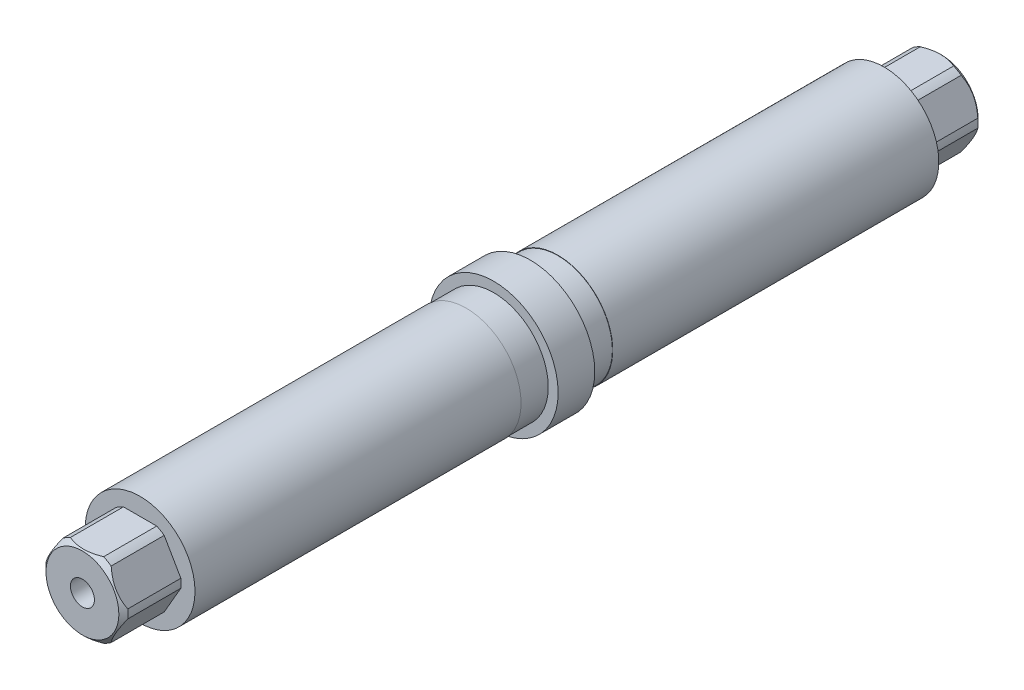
from build123d import *

# Parameters (mm, degrees)
SKETCH1_R                        = 11.176
CENTER_BOSS_DEPTH                = 3.175
SKETCH11_R                       = 9.4615
SHOULDER_RIGHT_HAND_THREAD_DEPTH = 4.7752
SHOULDER_START                   = 4.7752
SKETCH12_R                       = 9.4615
SHOULDER_LEFT_HAND_THREAD_DEPTH  = 4.7752
SKETCH2_R                        = 9.525
RH_THREAD_DEPTH                  = 56.5498
LH_START                         = 56.5498
SKETCH6_R                        = 9.525
LH_THREAD_DEPTH                  = 56.5498
HEX_BOSS_DEPTH                   = 10
SKETCH5_R                        = 11.176
SKETCH5_R_2                      = 7.112
ROUND_ENDS_DEPTH                 = 10
F_8_32_TAPPED_HOLE1_D            = 3.4544
F_8_32_TAPPED_HOLE1_DEPTH        = 12.2936
F_8_32_TAPPED_HOLE1_CBORE_D      = 4.1656
F_8_32_TAPPED_HOLE1_CBORE_DEPTH  = 6.35
F_8_32_TAPPED_HOLE1_TIP          = 1.037806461


with BuildPart() as part:
    # Sketch1 → CENTER BOSS (new, symmetric)
    with BuildSketch(Plane.XY):
        Circle(SKETCH1_R)
    extrude(amount=CENTER_BOSS_DEPTH, both=True)

    # Sketch11 → SHOULDER RIGHT HAND THREAD (add)
    with BuildSketch(Plane.XY.offset(3.175)):
        Circle(SKETCH11_R)
    extrude(amount=SHOULDER_RIGHT_HAND_THREAD_DEPTH)

    # Sketch12 → SHOULDER LEFT HAND THREAD (add)
    with BuildSketch(Plane(origin=(0, 0, -3.175), x_dir=(-1, 0, 0), z_dir=(0, 0, -1)).offset(SHOULDER_START)):
        with Locations(Location((0, 0, 0), (0, 0, 180))):
            Circle(SKETCH12_R)
    extrude(amount=-SHOULDER_LEFT_HAND_THREAD_DEPTH)

    # Sketch2 → RH THREAD (add)
    with BuildSketch(Plane.XY.offset(7.9502)):
        Circle(SKETCH2_R)
    extrude(amount=RH_THREAD_DEPTH)

    # Sketch6 → LH THREAD (add)
    with BuildSketch(Plane(origin=(0, 0, -7.9502), x_dir=(-1, 0, 0), z_dir=(0, 0, -1)).offset(LH_START)):
        with Locations(Location((0, 0, 0), (0, 0, 180))):
            Circle(SKETCH6_R)
    extrude(amount=-LH_THREAD_DEPTH)

    # Sketch4 → HEX BOSS (add)
    with BuildSketch(Plane.XY.offset(64.5)):
        Polygon((3.75277675, 6.5), (-3.75277675, 6.5), (-7.505553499, 0), (-3.75277675, -6.5), (3.75277675, -6.5), (7.505553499, 0), align=None)
    hex_boss = extrude(amount=HEX_BOSS_DEPTH)

    # Sketch5 → ROUND ENDS (cut)
    with BuildSketch(Plane.XY.offset(74.5)):
        Circle(SKETCH5_R)
        Circle(SKETCH5_R_2, mode=Mode.SUBTRACT)
    round_ends = extrude(amount=-ROUND_ENDS_DEPTH, mode=Mode.SUBTRACT)

    # Sketch7 → Cut-Revolve1 (revolve, cut)
    with BuildSketch(Plane(origin=(0, 0, 0), x_dir=(0, 1, 0), z_dir=(-1, 0, 0)), mode=Mode.PRIVATE) as cut_revolve1_sk:
        Polygon((-6.31825, -74.5), (-7.58825, -73.23), (-7.58825, -74.5), align=None)
    cut_revolve1 = revolve(cut_revolve1_sk.sketch.rotate(Axis((0, 0, 0), (0, 0, 1)), 270), axis=Axis((0, 0, 0), (0, 0, 1)), mode=Mode.SUBTRACT)

    # Mirror3: HEX BOSS, ROUND ENDS, Cut-Revolve1 across plane
    add(hex_boss.mirror(Plane.XY))
    add(round_ends.mirror(Plane.XY), mode=Mode.SUBTRACT)
    add(cut_revolve1.mirror(Plane.XY), mode=Mode.SUBTRACT)

    # 8-32 Tapped Hole1
    with Locations(Plane.XY.offset(74.5)):
        with Locations((0, 0)):
            CounterBoreHole(F_8_32_TAPPED_HOLE1_D / 2, F_8_32_TAPPED_HOLE1_CBORE_D / 2, F_8_32_TAPPED_HOLE1_CBORE_DEPTH, depth=F_8_32_TAPPED_HOLE1_DEPTH)
            with Locations((0, 0, -(F_8_32_TAPPED_HOLE1_DEPTH + F_8_32_TAPPED_HOLE1_TIP / 2))):  # 118° drill point
                Cone(0, F_8_32_TAPPED_HOLE1_D / 2, F_8_32_TAPPED_HOLE1_TIP, mode=Mode.SUBTRACT)


solid = part.part
